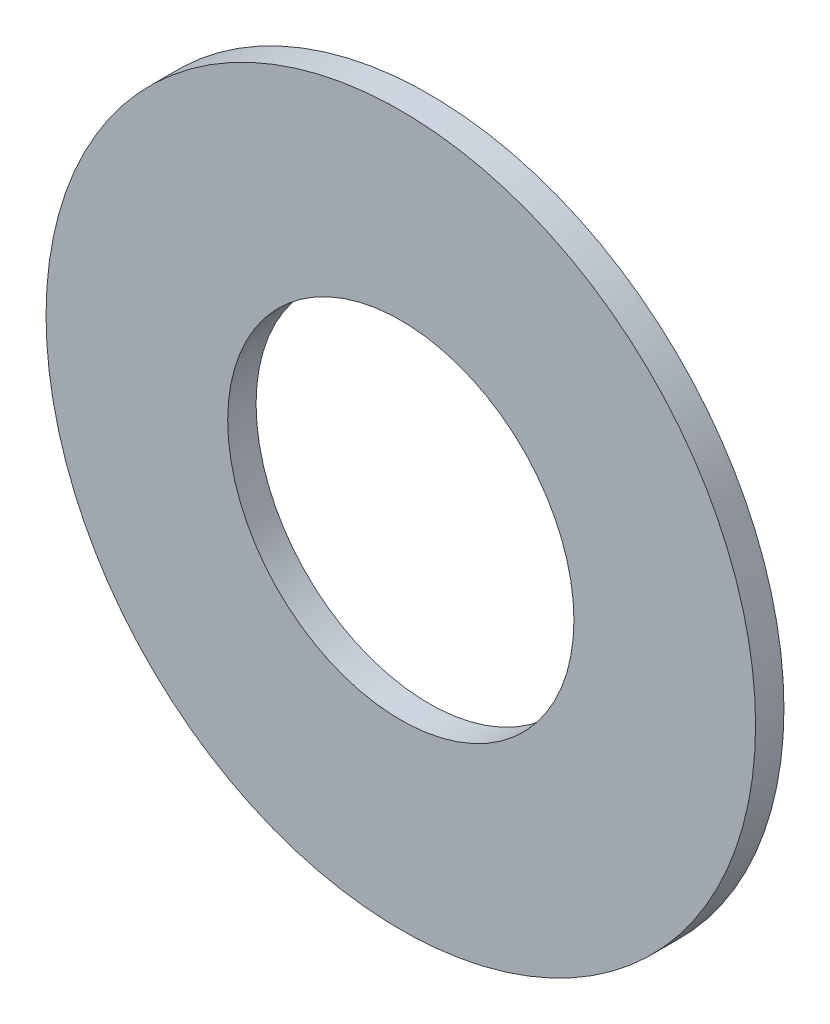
ISO-10303-21;
HEADER;
FILE_DESCRIPTION(('STEP AP214'),'2;1');
FILE_NAME('part.step','',(''),(''),'','','');
FILE_SCHEMA(('AUTOMOTIVE_DESIGN { 1 0 10303 214 1 1 1 1 }'));
ENDSEC;
DATA;
#1=APPLICATION_CONTEXT('core data for automotive mechanical design processes');
#2=APPLICATION_PROTOCOL_DEFINITION('international standard','automotive_design',2000,#1);
#3=PRODUCT_CONTEXT('',#1,'mechanical');
#4=PRODUCT('Part','Part','',(#3));
#5=PRODUCT_RELATED_PRODUCT_CATEGORY('part','',(#4));
#6=PRODUCT_DEFINITION_FORMATION('','',#4);
#7=PRODUCT_DEFINITION_CONTEXT('part definition',#1,'design');
#8=PRODUCT_DEFINITION('design','',#6,#7);
#9=PRODUCT_DEFINITION_SHAPE('','',#8);
#10=(LENGTH_UNIT() NAMED_UNIT(*) SI_UNIT(.MILLI.,.METRE.));
#11=(NAMED_UNIT(*) PLANE_ANGLE_UNIT() SI_UNIT($,.RADIAN.));
#12=(NAMED_UNIT(*) SI_UNIT($,.STERADIAN.) SOLID_ANGLE_UNIT());
#13=UNCERTAINTY_MEASURE_WITH_UNIT(LENGTH_MEASURE(1.E-05),#10,'distance_accuracy_value','');
#14=(GEOMETRIC_REPRESENTATION_CONTEXT(3) GLOBAL_UNCERTAINTY_ASSIGNED_CONTEXT((#13)) GLOBAL_UNIT_ASSIGNED_CONTEXT((#10,
#11,#12)) REPRESENTATION_CONTEXT('',''));
#15=CARTESIAN_POINT('',(0.,0.,0.));
#16=DIRECTION('',(0.,0.,1.));
#17=DIRECTION('',(1.,0.,0.));
#18=AXIS2_PLACEMENT_3D('',#15,#16,#17);
#19=CARTESIAN_POINT('',(0.,0.,1.));
#20=DIRECTION('',(0.,0.,1.));
#21=DIRECTION('',(1.,0.,0.));
#22=AXIS2_PLACEMENT_3D('',#19,#20,#21);
#23=PLANE('',#22);
#24=CARTESIAN_POINT('',(0.,0.,1.));
#25=DIRECTION('',(0.,0.,1.));
#26=DIRECTION('',(1.,0.,0.));
#27=AXIS2_PLACEMENT_3D('',#24,#25,#26);
#28=CIRCLE('',#27,6.1);
#29=CARTESIAN_POINT('',(6.1,0.,1.));
#30=VERTEX_POINT('',#29);
#31=EDGE_CURVE('E26',#30,#30,#28,.F.);
#32=ORIENTED_EDGE('',*,*,#31,.T.);
#33=EDGE_LOOP('',(#32));
#34=FACE_BOUND('',#33,.T.);
#35=CARTESIAN_POINT('',(0.,0.,1.));
#36=DIRECTION('',(0.,0.,1.));
#37=DIRECTION('',(1.,0.,0.));
#38=AXIS2_PLACEMENT_3D('',#35,#36,#37);
#39=CIRCLE('',#38,12.5);
#40=CARTESIAN_POINT('',(12.5,0.,1.));
#41=VERTEX_POINT('',#40);
#42=EDGE_CURVE('E17',#41,#41,#39,.F.);
#43=ORIENTED_EDGE('',*,*,#42,.F.);
#44=EDGE_LOOP('',(#43));
#45=FACE_BOUND('',#44,.T.);
#46=ADVANCED_FACE('F14',(#34,#45),#23,.T.);
#47=CARTESIAN_POINT('',(0.,0.,0.5));
#48=DIRECTION('',(0.,0.,1.));
#49=DIRECTION('',(1.,0.,0.));
#50=AXIS2_PLACEMENT_3D('',#47,#48,#49);
#51=CYLINDRICAL_SURFACE('',#50,12.5);
#52=CARTESIAN_POINT('',(0.,0.,0.));
#53=DIRECTION('',(0.,0.,1.));
#54=DIRECTION('',(1.,0.,0.));
#55=AXIS2_PLACEMENT_3D('',#52,#53,#54);
#56=CIRCLE('',#55,12.5);
#57=CARTESIAN_POINT('',(12.5,0.,0.));
#58=VERTEX_POINT('',#57);
#59=EDGE_CURVE('E21',#58,#58,#56,.T.);
#60=ORIENTED_EDGE('',*,*,#59,.T.);
#61=EDGE_LOOP('',(#60));
#62=FACE_BOUND('',#61,.T.);
#63=ORIENTED_EDGE('',*,*,#42,.T.);
#64=EDGE_LOOP('',(#63));
#65=FACE_BOUND('',#64,.T.);
#66=ADVANCED_FACE('F34',(#62,#65),#51,.T.);
#67=CARTESIAN_POINT('',(0.,0.,0.5));
#68=DIRECTION('',(0.,0.,1.));
#69=DIRECTION('',(1.,0.,0.));
#70=AXIS2_PLACEMENT_3D('',#67,#68,#69);
#71=CYLINDRICAL_SURFACE('',#70,6.1);
#72=CARTESIAN_POINT('',(0.,0.,0.));
#73=DIRECTION('',(0.,0.,1.));
#74=DIRECTION('',(1.,0.,0.));
#75=AXIS2_PLACEMENT_3D('',#72,#73,#74);
#76=CIRCLE('',#75,6.1);
#77=CARTESIAN_POINT('',(6.1,0.,0.));
#78=VERTEX_POINT('',#77);
#79=EDGE_CURVE('E10',#78,#78,#76,.F.);
#80=ORIENTED_EDGE('',*,*,#79,.T.);
#81=EDGE_LOOP('',(#80));
#82=FACE_BOUND('',#81,.T.);
#83=ORIENTED_EDGE('',*,*,#31,.F.);
#84=EDGE_LOOP('',(#83));
#85=FACE_BOUND('',#84,.T.);
#86=ADVANCED_FACE('F41',(#82,#85),#71,.F.);
#87=CARTESIAN_POINT('',(0.,0.,0.));
#88=DIRECTION('',(0.,0.,1.));
#89=DIRECTION('',(1.,0.,0.));
#90=AXIS2_PLACEMENT_3D('',#87,#88,#89);
#91=PLANE('',#90);
#92=ORIENTED_EDGE('',*,*,#79,.F.);
#93=EDGE_LOOP('',(#92));
#94=FACE_BOUND('',#93,.T.);
#95=ORIENTED_EDGE('',*,*,#59,.F.);
#96=EDGE_LOOP('',(#95));
#97=FACE_BOUND('',#96,.T.);
#98=ADVANCED_FACE('F43',(#94,#97),#91,.F.);
#99=CLOSED_SHELL('',(#46,#66,#86,#98));
#100=MANIFOLD_SOLID_BREP('B1',#99);
#101=ADVANCED_BREP_SHAPE_REPRESENTATION('',(#18,#100),#14);
#102=SHAPE_DEFINITION_REPRESENTATION(#9,#101);
ENDSEC;
END-ISO-10303-21;
